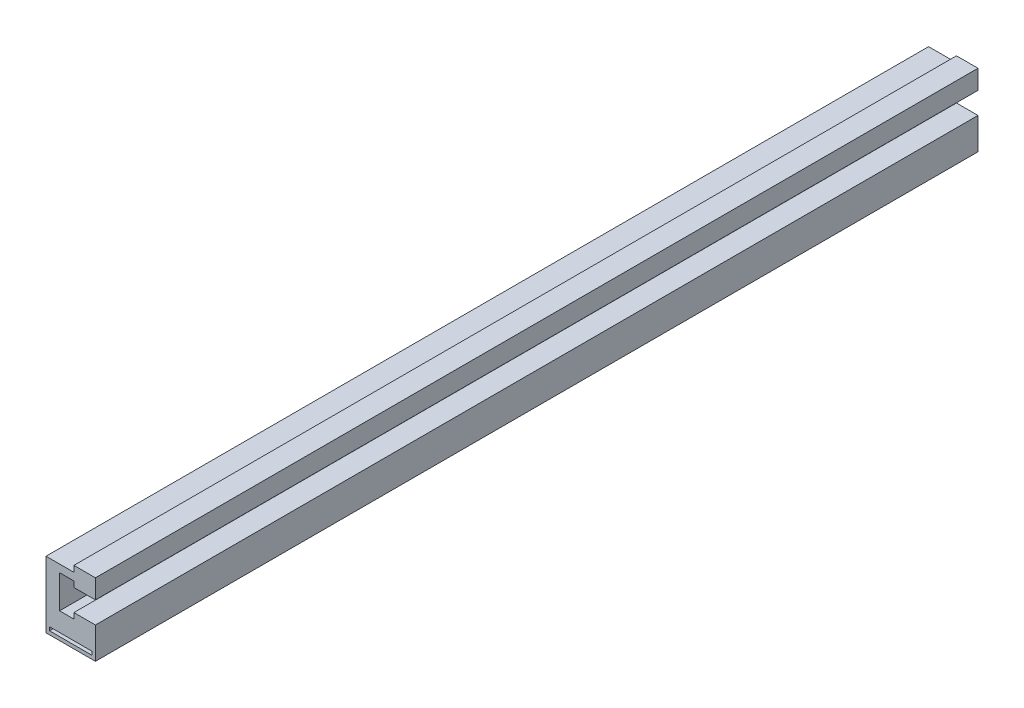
ISO-10303-21;
HEADER;
FILE_DESCRIPTION(('STEP AP214'),'2;1');
FILE_NAME('part.step','',(''),(''),'','','');
FILE_SCHEMA(('AUTOMOTIVE_DESIGN { 1 0 10303 214 1 1 1 1 }'));
ENDSEC;
DATA;
#1=APPLICATION_CONTEXT('core data for automotive mechanical design processes');
#2=APPLICATION_PROTOCOL_DEFINITION('international standard','automotive_design',2000,#1);
#3=PRODUCT_CONTEXT('',#1,'mechanical');
#4=PRODUCT('Part','Part','',(#3));
#5=PRODUCT_RELATED_PRODUCT_CATEGORY('part','',(#4));
#6=PRODUCT_DEFINITION_FORMATION('','',#4);
#7=PRODUCT_DEFINITION_CONTEXT('part definition',#1,'design');
#8=PRODUCT_DEFINITION('design','',#6,#7);
#9=PRODUCT_DEFINITION_SHAPE('','',#8);
#10=(LENGTH_UNIT() NAMED_UNIT(*) SI_UNIT(.MILLI.,.METRE.));
#11=(NAMED_UNIT(*) PLANE_ANGLE_UNIT() SI_UNIT($,.RADIAN.));
#12=(NAMED_UNIT(*) SI_UNIT($,.STERADIAN.) SOLID_ANGLE_UNIT());
#13=UNCERTAINTY_MEASURE_WITH_UNIT(LENGTH_MEASURE(1.E-05),#10,'distance_accuracy_value','');
#14=(GEOMETRIC_REPRESENTATION_CONTEXT(3) GLOBAL_UNCERTAINTY_ASSIGNED_CONTEXT((#13)) GLOBAL_UNIT_ASSIGNED_CONTEXT((#10,
#11,#12)) REPRESENTATION_CONTEXT('',''));
#15=CARTESIAN_POINT('',(0.,0.,0.));
#16=DIRECTION('',(0.,0.,1.));
#17=DIRECTION('',(1.,0.,0.));
#18=AXIS2_PLACEMENT_3D('',#15,#16,#17);
#19=CARTESIAN_POINT('',(14.,0.,0.));
#20=DIRECTION('',(0.,0.,1.));
#21=DIRECTION('',(1.,0.,0.));
#22=AXIS2_PLACEMENT_3D('',#19,#20,#21);
#23=PLANE('',#22);
#24=DIRECTION('',(0.,1.,0.));
#25=VECTOR('',#24,1.);
#26=CARTESIAN_POINT('',(14.,30.15,0.));
#27=LINE('',#26,#25);
#28=CARTESIAN_POINT('',(14.,30.15,0.));
#29=VERTEX_POINT('',#28);
#30=CARTESIAN_POINT('',(14.,41.,0.));
#31=VERTEX_POINT('',#30);
#32=EDGE_CURVE('E216',#29,#31,#27,.T.);
#33=ORIENTED_EDGE('',*,*,#32,.F.);
#34=DIRECTION('',(-1.,0.,0.));
#35=VECTOR('',#34,1.);
#36=CARTESIAN_POINT('',(14.,30.15,0.));
#37=LINE('',#36,#35);
#38=CARTESIAN_POINT('',(1.79999999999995,30.15,0.));
#39=VERTEX_POINT('',#38);
#40=EDGE_CURVE('E255',#29,#39,#37,.T.);
#41=ORIENTED_EDGE('',*,*,#40,.T.);
#42=DIRECTION('',(0.,-1.,0.));
#43=VECTOR('',#42,1.);
#44=CARTESIAN_POINT('',(1.79999999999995,33.35,0.));
#45=LINE('',#44,#43);
#46=CARTESIAN_POINT('',(1.79999999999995,33.35,0.));
#47=VERTEX_POINT('',#46);
#48=EDGE_CURVE('E252',#47,#39,#45,.T.);
#49=ORIENTED_EDGE('',*,*,#48,.F.);
#50=DIRECTION('',(-1.,0.,0.));
#51=VECTOR('',#50,1.);
#52=CARTESIAN_POINT('',(1.79999999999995,33.35,0.));
#53=LINE('',#52,#51);
#54=CARTESIAN_POINT('',(-6.30000000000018,33.35,0.));
#55=VERTEX_POINT('',#54);
#56=EDGE_CURVE('E249',#47,#55,#53,.T.);
#57=ORIENTED_EDGE('',*,*,#56,.T.);
#58=DIRECTION('',(0.,-1.,0.));
#59=VECTOR('',#58,1.);
#60=CARTESIAN_POINT('',(-6.30000000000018,33.35,0.));
#61=LINE('',#60,#59);
#62=CARTESIAN_POINT('',(-6.30000000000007,14.6499999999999,0.));
#63=VERTEX_POINT('',#62);
#64=EDGE_CURVE('E246',#55,#63,#61,.T.);
#65=ORIENTED_EDGE('',*,*,#64,.T.);
#66=DIRECTION('',(-1.,0.,0.));
#67=VECTOR('',#66,1.);
#68=CARTESIAN_POINT('',(1.79999999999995,14.6499999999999,0.));
#69=LINE('',#68,#67);
#70=CARTESIAN_POINT('',(1.79999999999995,14.6499999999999,0.));
#71=VERTEX_POINT('',#70);
#72=EDGE_CURVE('E243',#71,#63,#69,.T.);
#73=ORIENTED_EDGE('',*,*,#72,.F.);
#74=DIRECTION('',(0.,-1.,0.));
#75=VECTOR('',#74,1.);
#76=CARTESIAN_POINT('',(1.79999999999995,17.85,0.));
#77=LINE('',#76,#75);
#78=CARTESIAN_POINT('',(1.79999999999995,17.85,0.));
#79=VERTEX_POINT('',#78);
#80=EDGE_CURVE('E240',#79,#71,#77,.T.);
#81=ORIENTED_EDGE('',*,*,#80,.F.);
#82=DIRECTION('',(-1.,0.,0.));
#83=VECTOR('',#82,1.);
#84=CARTESIAN_POINT('',(14.,17.85,0.));
#85=LINE('',#84,#83);
#86=CARTESIAN_POINT('',(14.,17.85,0.));
#87=VERTEX_POINT('',#86);
#88=EDGE_CURVE('E237',#87,#79,#85,.T.);
#89=ORIENTED_EDGE('',*,*,#88,.F.);
#90=DIRECTION('',(0.,1.,0.));
#91=VECTOR('',#90,1.);
#92=CARTESIAN_POINT('',(14.,0.,0.));
#93=LINE('',#92,#91);
#94=CARTESIAN_POINT('',(14.,0.,0.));
#95=VERTEX_POINT('',#94);
#96=EDGE_CURVE('E234',#95,#87,#93,.T.);
#97=ORIENTED_EDGE('',*,*,#96,.F.);
#98=DIRECTION('',(-1.,0.,0.));
#99=VECTOR('',#98,1.);
#100=CARTESIAN_POINT('',(14.,0.,0.));
#101=LINE('',#100,#99);
#102=CARTESIAN_POINT('',(-14.,0.,0.));
#103=VERTEX_POINT('',#102);
#104=EDGE_CURVE('E231',#95,#103,#101,.T.);
#105=ORIENTED_EDGE('',*,*,#104,.T.);
#106=DIRECTION('',(0.,1.,0.));
#107=VECTOR('',#106,1.);
#108=CARTESIAN_POINT('',(-14.,0.,0.));
#109=LINE('',#108,#107);
#110=CARTESIAN_POINT('',(-14.,37.6,0.));
#111=VERTEX_POINT('',#110);
#112=EDGE_CURVE('E228',#103,#111,#109,.T.);
#113=ORIENTED_EDGE('',*,*,#112,.T.);
#114=DIRECTION('',(-1.,0.,0.));
#115=VECTOR('',#114,1.);
#116=CARTESIAN_POINT('',(1.79999999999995,37.6,0.));
#117=LINE('',#116,#115);
#118=CARTESIAN_POINT('',(1.79999999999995,37.6,0.));
#119=VERTEX_POINT('',#118);
#120=EDGE_CURVE('E225',#119,#111,#117,.T.);
#121=ORIENTED_EDGE('',*,*,#120,.F.);
#122=DIRECTION('',(0.,1.,0.));
#123=VECTOR('',#122,1.);
#124=CARTESIAN_POINT('',(1.79999999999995,37.6,0.));
#125=LINE('',#124,#123);
#126=CARTESIAN_POINT('',(1.79999999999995,41.,0.));
#127=VERTEX_POINT('',#126);
#128=EDGE_CURVE('E222',#119,#127,#125,.T.);
#129=ORIENTED_EDGE('',*,*,#128,.T.);
#130=DIRECTION('',(-1.,0.,0.));
#131=VECTOR('',#130,1.);
#132=CARTESIAN_POINT('',(14.,41.,0.));
#133=LINE('',#132,#131);
#134=EDGE_CURVE('E219',#31,#127,#133,.T.);
#135=ORIENTED_EDGE('',*,*,#134,.F.);
#136=EDGE_LOOP('',(#33,#41,#49,#57,#65,#73,#81,#89,#97,#105,#113,#121,#129,#135));
#137=FACE_BOUND('',#136,.T.);
#138=DIRECTION('',(0.,1.,0.));
#139=VECTOR('',#138,1.);
#140=CARTESIAN_POINT('',(-12.,1.99999999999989,0.));
#141=LINE('',#140,#139);
#142=CARTESIAN_POINT('',(-12.,1.99999999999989,0.));
#143=VERTEX_POINT('',#142);
#144=CARTESIAN_POINT('',(-12.,3.99999999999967,0.));
#145=VERTEX_POINT('',#144);
#146=EDGE_CURVE('E140',#143,#145,#141,.T.);
#147=ORIENTED_EDGE('',*,*,#146,.F.);
#148=DIRECTION('',(1.,0.,0.));
#149=VECTOR('',#148,1.);
#150=CARTESIAN_POINT('',(-12.,1.99999999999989,0.));
#151=LINE('',#150,#149);
#152=CARTESIAN_POINT('',(12.,2.,0.));
#153=VERTEX_POINT('',#152);
#154=EDGE_CURVE('E167',#143,#153,#151,.T.);
#155=ORIENTED_EDGE('',*,*,#154,.T.);
#156=DIRECTION('',(0.,-1.,0.));
#157=VECTOR('',#156,1.);
#158=CARTESIAN_POINT('',(12.,3.9999999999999,0.));
#159=LINE('',#158,#157);
#160=CARTESIAN_POINT('',(12.,3.9999999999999,0.));
#161=VERTEX_POINT('',#160);
#162=EDGE_CURVE('E29',#161,#153,#159,.T.);
#163=ORIENTED_EDGE('',*,*,#162,.F.);
#164=DIRECTION('',(-1.,0.,0.));
#165=VECTOR('',#164,1.);
#166=CARTESIAN_POINT('',(12.,3.9999999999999,0.));
#167=LINE('',#166,#165);
#168=EDGE_CURVE('E164',#161,#145,#167,.T.);
#169=ORIENTED_EDGE('',*,*,#168,.T.);
#170=EDGE_LOOP('',(#147,#155,#163,#169));
#171=FACE_BOUND('',#170,.T.);
#172=ADVANCED_FACE('F14',(#137,#171),#23,.F.);
#173=CARTESIAN_POINT('',(14.,0.,500.));
#174=DIRECTION('',(0.,0.,1.));
#175=DIRECTION('',(1.,0.,0.));
#176=AXIS2_PLACEMENT_3D('',#173,#174,#175);
#177=PLANE('',#176);
#178=DIRECTION('',(0.,1.,0.));
#179=VECTOR('',#178,1.);
#180=CARTESIAN_POINT('',(14.,30.15,500.));
#181=LINE('',#180,#179);
#182=CARTESIAN_POINT('',(14.,30.15,500.));
#183=VERTEX_POINT('',#182);
#184=CARTESIAN_POINT('',(14.,41.,500.));
#185=VERTEX_POINT('',#184);
#186=EDGE_CURVE('E144',#183,#185,#181,.T.);
#187=ORIENTED_EDGE('',*,*,#186,.T.);
#188=DIRECTION('',(-1.,0.,0.));
#189=VECTOR('',#188,1.);
#190=CARTESIAN_POINT('',(14.,41.,500.));
#191=LINE('',#190,#189);
#192=CARTESIAN_POINT('',(1.79999999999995,41.,500.));
#193=VERTEX_POINT('',#192);
#194=EDGE_CURVE('E177',#185,#193,#191,.T.);
#195=ORIENTED_EDGE('',*,*,#194,.T.);
#196=DIRECTION('',(0.,1.,0.));
#197=VECTOR('',#196,1.);
#198=CARTESIAN_POINT('',(1.79999999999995,37.6,500.));
#199=LINE('',#198,#197);
#200=CARTESIAN_POINT('',(1.79999999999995,37.6,500.));
#201=VERTEX_POINT('',#200);
#202=EDGE_CURVE('E180',#201,#193,#199,.T.);
#203=ORIENTED_EDGE('',*,*,#202,.F.);
#204=DIRECTION('',(-1.,0.,0.));
#205=VECTOR('',#204,1.);
#206=CARTESIAN_POINT('',(1.79999999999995,37.6,500.));
#207=LINE('',#206,#205);
#208=CARTESIAN_POINT('',(-14.,37.6,500.));
#209=VERTEX_POINT('',#208);
#210=EDGE_CURVE('E183',#201,#209,#207,.T.);
#211=ORIENTED_EDGE('',*,*,#210,.T.);
#212=DIRECTION('',(0.,1.,0.));
#213=VECTOR('',#212,1.);
#214=CARTESIAN_POINT('',(-14.,0.,500.));
#215=LINE('',#214,#213);
#216=CARTESIAN_POINT('',(-14.,0.,500.));
#217=VERTEX_POINT('',#216);
#218=EDGE_CURVE('E186',#217,#209,#215,.T.);
#219=ORIENTED_EDGE('',*,*,#218,.F.);
#220=DIRECTION('',(-1.,0.,0.));
#221=VECTOR('',#220,1.);
#222=CARTESIAN_POINT('',(14.,0.,500.));
#223=LINE('',#222,#221);
#224=CARTESIAN_POINT('',(14.,0.,500.));
#225=VERTEX_POINT('',#224);
#226=EDGE_CURVE('E189',#225,#217,#223,.T.);
#227=ORIENTED_EDGE('',*,*,#226,.F.);
#228=DIRECTION('',(0.,1.,0.));
#229=VECTOR('',#228,1.);
#230=CARTESIAN_POINT('',(14.,0.,500.));
#231=LINE('',#230,#229);
#232=CARTESIAN_POINT('',(14.,17.85,500.));
#233=VERTEX_POINT('',#232);
#234=EDGE_CURVE('E192',#225,#233,#231,.T.);
#235=ORIENTED_EDGE('',*,*,#234,.T.);
#236=DIRECTION('',(-1.,0.,0.));
#237=VECTOR('',#236,1.);
#238=CARTESIAN_POINT('',(14.,17.85,500.));
#239=LINE('',#238,#237);
#240=CARTESIAN_POINT('',(1.79999999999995,17.85,500.));
#241=VERTEX_POINT('',#240);
#242=EDGE_CURVE('E195',#233,#241,#239,.T.);
#243=ORIENTED_EDGE('',*,*,#242,.T.);
#244=DIRECTION('',(0.,-1.,0.));
#245=VECTOR('',#244,1.);
#246=CARTESIAN_POINT('',(1.79999999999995,17.85,500.));
#247=LINE('',#246,#245);
#248=CARTESIAN_POINT('',(1.79999999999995,14.6499999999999,500.));
#249=VERTEX_POINT('',#248);
#250=EDGE_CURVE('E198',#241,#249,#247,.T.);
#251=ORIENTED_EDGE('',*,*,#250,.T.);
#252=DIRECTION('',(-1.,0.,0.));
#253=VECTOR('',#252,1.);
#254=CARTESIAN_POINT('',(1.79999999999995,14.6499999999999,500.));
#255=LINE('',#254,#253);
#256=CARTESIAN_POINT('',(-6.30000000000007,14.6499999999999,500.));
#257=VERTEX_POINT('',#256);
#258=EDGE_CURVE('E201',#249,#257,#255,.T.);
#259=ORIENTED_EDGE('',*,*,#258,.T.);
#260=DIRECTION('',(0.,-1.,0.));
#261=VECTOR('',#260,1.);
#262=CARTESIAN_POINT('',(-6.30000000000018,33.35,500.));
#263=LINE('',#262,#261);
#264=CARTESIAN_POINT('',(-6.30000000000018,33.35,500.));
#265=VERTEX_POINT('',#264);
#266=EDGE_CURVE('E204',#265,#257,#263,.T.);
#267=ORIENTED_EDGE('',*,*,#266,.F.);
#268=DIRECTION('',(-1.,0.,0.));
#269=VECTOR('',#268,1.);
#270=CARTESIAN_POINT('',(1.79999999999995,33.35,500.));
#271=LINE('',#270,#269);
#272=CARTESIAN_POINT('',(1.79999999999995,33.35,500.));
#273=VERTEX_POINT('',#272);
#274=EDGE_CURVE('E207',#273,#265,#271,.T.);
#275=ORIENTED_EDGE('',*,*,#274,.F.);
#276=DIRECTION('',(0.,-1.,0.));
#277=VECTOR('',#276,1.);
#278=CARTESIAN_POINT('',(1.79999999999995,33.35,500.));
#279=LINE('',#278,#277);
#280=CARTESIAN_POINT('',(1.79999999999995,30.15,500.));
#281=VERTEX_POINT('',#280);
#282=EDGE_CURVE('E210',#273,#281,#279,.T.);
#283=ORIENTED_EDGE('',*,*,#282,.T.);
#284=DIRECTION('',(-1.,0.,0.));
#285=VECTOR('',#284,1.);
#286=CARTESIAN_POINT('',(14.,30.15,500.));
#287=LINE('',#286,#285);
#288=EDGE_CURVE('E213',#183,#281,#287,.T.);
#289=ORIENTED_EDGE('',*,*,#288,.F.);
#290=EDGE_LOOP('',(#187,#195,#203,#211,#219,#227,#235,#243,#251,#259,#267,#275,#283,#289));
#291=FACE_BOUND('',#290,.T.);
#292=DIRECTION('',(1.,0.,0.));
#293=VECTOR('',#292,1.);
#294=CARTESIAN_POINT('',(-12.,1.99999999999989,500.));
#295=LINE('',#294,#293);
#296=CARTESIAN_POINT('',(-12.,1.99999999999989,500.));
#297=VERTEX_POINT('',#296);
#298=CARTESIAN_POINT('',(12.,2.,500.));
#299=VERTEX_POINT('',#298);
#300=EDGE_CURVE('E158',#297,#299,#295,.T.);
#301=ORIENTED_EDGE('',*,*,#300,.F.);
#302=DIRECTION('',(0.,1.,0.));
#303=VECTOR('',#302,1.);
#304=CARTESIAN_POINT('',(-12.,1.99999999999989,500.));
#305=LINE('',#304,#303);
#306=CARTESIAN_POINT('',(-12.,3.99999999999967,500.));
#307=VERTEX_POINT('',#306);
#308=EDGE_CURVE('E37',#297,#307,#305,.T.);
#309=ORIENTED_EDGE('',*,*,#308,.T.);
#310=DIRECTION('',(-1.,0.,0.));
#311=VECTOR('',#310,1.);
#312=CARTESIAN_POINT('',(12.,3.9999999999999,500.));
#313=LINE('',#312,#311);
#314=CARTESIAN_POINT('',(12.,3.9999999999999,500.));
#315=VERTEX_POINT('',#314);
#316=EDGE_CURVE('E148',#315,#307,#313,.T.);
#317=ORIENTED_EDGE('',*,*,#316,.F.);
#318=DIRECTION('',(0.,-1.,0.));
#319=VECTOR('',#318,1.);
#320=CARTESIAN_POINT('',(12.,3.9999999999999,500.));
#321=LINE('',#320,#319);
#322=EDGE_CURVE('E153',#315,#299,#321,.T.);
#323=ORIENTED_EDGE('',*,*,#322,.T.);
#324=EDGE_LOOP('',(#301,#309,#317,#323));
#325=FACE_BOUND('',#324,.T.);
#326=ADVANCED_FACE('F156',(#291,#325),#177,.T.);
#327=CARTESIAN_POINT('',(14.,30.15,0.));
#328=DIRECTION('',(1.,0.,0.));
#329=DIRECTION('',(0.,0.,-1.));
#330=AXIS2_PLACEMENT_3D('',#327,#328,#329);
#331=PLANE('',#330);
#332=DIRECTION('',(0.,0.,1.));
#333=VECTOR('',#332,1.);
#334=CARTESIAN_POINT('',(14.,30.15,0.));
#335=LINE('',#334,#333);
#336=EDGE_CURVE('E9',#29,#183,#335,.T.);
#337=ORIENTED_EDGE('',*,*,#336,.F.);
#338=ORIENTED_EDGE('',*,*,#32,.T.);
#339=DIRECTION('',(0.,0.,1.));
#340=VECTOR('',#339,1.);
#341=CARTESIAN_POINT('',(14.,41.,0.));
#342=LINE('',#341,#340);
#343=EDGE_CURVE('E258',#31,#185,#342,.T.);
#344=ORIENTED_EDGE('',*,*,#343,.T.);
#345=ORIENTED_EDGE('',*,*,#186,.F.);
#346=EDGE_LOOP('',(#337,#338,#344,#345));
#347=FACE_BOUND('',#346,.T.);
#348=ADVANCED_FACE('F294',(#347),#331,.T.);
#349=CARTESIAN_POINT('',(14.,30.15,0.));
#350=DIRECTION('',(0.,1.,0.));
#351=DIRECTION('',(0.,0.,-1.));
#352=AXIS2_PLACEMENT_3D('',#349,#350,#351);
#353=PLANE('',#352);
#354=DIRECTION('',(0.,0.,1.));
#355=VECTOR('',#354,1.);
#356=CARTESIAN_POINT('',(1.79999999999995,30.15,0.));
#357=LINE('',#356,#355);
#358=EDGE_CURVE('E22',#39,#281,#357,.T.);
#359=ORIENTED_EDGE('',*,*,#358,.F.);
#360=ORIENTED_EDGE('',*,*,#40,.F.);
#361=ORIENTED_EDGE('',*,*,#336,.T.);
#362=ORIENTED_EDGE('',*,*,#288,.T.);
#363=EDGE_LOOP('',(#359,#360,#361,#362));
#364=FACE_BOUND('',#363,.T.);
#365=ADVANCED_FACE('F16',(#364),#353,.F.);
#366=CARTESIAN_POINT('',(1.79999999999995,33.35,0.));
#367=DIRECTION('',(-1.,0.,0.));
#368=DIRECTION('',(0.,0.,1.));
#369=AXIS2_PLACEMENT_3D('',#366,#367,#368);
#370=PLANE('',#369);
#371=DIRECTION('',(0.,0.,1.));
#372=VECTOR('',#371,1.);
#373=CARTESIAN_POINT('',(1.79999999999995,33.35,0.));
#374=LINE('',#373,#372);
#375=EDGE_CURVE('E280',#47,#273,#374,.T.);
#376=ORIENTED_EDGE('',*,*,#375,.F.);
#377=ORIENTED_EDGE('',*,*,#48,.T.);
#378=ORIENTED_EDGE('',*,*,#358,.T.);
#379=ORIENTED_EDGE('',*,*,#282,.F.);
#380=EDGE_LOOP('',(#376,#377,#378,#379));
#381=FACE_BOUND('',#380,.T.);
#382=ADVANCED_FACE('F283',(#381),#370,.T.);
#383=CARTESIAN_POINT('',(1.79999999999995,33.35,0.));
#384=DIRECTION('',(0.,1.,0.));
#385=DIRECTION('',(0.,0.,-1.));
#386=AXIS2_PLACEMENT_3D('',#383,#384,#385);
#387=PLANE('',#386);
#388=DIRECTION('',(0.,0.,1.));
#389=VECTOR('',#388,1.);
#390=CARTESIAN_POINT('',(-6.30000000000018,33.35,0.));
#391=LINE('',#390,#389);
#392=EDGE_CURVE('E278',#55,#265,#391,.T.);
#393=ORIENTED_EDGE('',*,*,#392,.F.);
#394=ORIENTED_EDGE('',*,*,#56,.F.);
#395=ORIENTED_EDGE('',*,*,#375,.T.);
#396=ORIENTED_EDGE('',*,*,#274,.T.);
#397=EDGE_LOOP('',(#393,#394,#395,#396));
#398=FACE_BOUND('',#397,.T.);
#399=ADVANCED_FACE('F335',(#398),#387,.F.);
#400=CARTESIAN_POINT('',(-6.30000000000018,33.35,0.));
#401=DIRECTION('',(-1.,0.,0.));
#402=DIRECTION('',(0.,1.,0.));
#403=AXIS2_PLACEMENT_3D('',#400,#401,#402);
#404=PLANE('',#403);
#405=DIRECTION('',(0.,0.,1.));
#406=VECTOR('',#405,1.);
#407=CARTESIAN_POINT('',(-6.30000000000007,14.6499999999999,0.));
#408=LINE('',#407,#406);
#409=EDGE_CURVE('E276',#63,#257,#408,.T.);
#410=ORIENTED_EDGE('',*,*,#409,.F.);
#411=ORIENTED_EDGE('',*,*,#64,.F.);
#412=ORIENTED_EDGE('',*,*,#392,.T.);
#413=ORIENTED_EDGE('',*,*,#266,.T.);
#414=EDGE_LOOP('',(#410,#411,#412,#413));
#415=FACE_BOUND('',#414,.T.);
#416=ADVANCED_FACE('F333',(#415),#404,.F.);
#417=CARTESIAN_POINT('',(1.79999999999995,14.6499999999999,0.));
#418=DIRECTION('',(0.,1.,0.));
#419=DIRECTION('',(0.,0.,-1.));
#420=AXIS2_PLACEMENT_3D('',#417,#418,#419);
#421=PLANE('',#420);
#422=DIRECTION('',(0.,0.,1.));
#423=VECTOR('',#422,1.);
#424=CARTESIAN_POINT('',(1.79999999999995,14.6499999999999,0.));
#425=LINE('',#424,#423);
#426=EDGE_CURVE('E274',#71,#249,#425,.T.);
#427=ORIENTED_EDGE('',*,*,#426,.F.);
#428=ORIENTED_EDGE('',*,*,#72,.T.);
#429=ORIENTED_EDGE('',*,*,#409,.T.);
#430=ORIENTED_EDGE('',*,*,#258,.F.);
#431=EDGE_LOOP('',(#427,#428,#429,#430));
#432=FACE_BOUND('',#431,.T.);
#433=ADVANCED_FACE('F330',(#432),#421,.T.);
#434=CARTESIAN_POINT('',(1.79999999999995,17.85,0.));
#435=DIRECTION('',(-1.,0.,0.));
#436=DIRECTION('',(0.,0.,1.));
#437=AXIS2_PLACEMENT_3D('',#434,#435,#436);
#438=PLANE('',#437);
#439=DIRECTION('',(0.,0.,1.));
#440=VECTOR('',#439,1.);
#441=CARTESIAN_POINT('',(1.79999999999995,17.85,0.));
#442=LINE('',#441,#440);
#443=EDGE_CURVE('E272',#79,#241,#442,.T.);
#444=ORIENTED_EDGE('',*,*,#443,.F.);
#445=ORIENTED_EDGE('',*,*,#80,.T.);
#446=ORIENTED_EDGE('',*,*,#426,.T.);
#447=ORIENTED_EDGE('',*,*,#250,.F.);
#448=EDGE_LOOP('',(#444,#445,#446,#447));
#449=FACE_BOUND('',#448,.T.);
#450=ADVANCED_FACE('F326',(#449),#438,.T.);
#451=CARTESIAN_POINT('',(14.,17.85,0.));
#452=DIRECTION('',(0.,1.,0.));
#453=DIRECTION('',(0.,0.,-1.));
#454=AXIS2_PLACEMENT_3D('',#451,#452,#453);
#455=PLANE('',#454);
#456=DIRECTION('',(0.,0.,1.));
#457=VECTOR('',#456,1.);
#458=CARTESIAN_POINT('',(14.,17.85,0.));
#459=LINE('',#458,#457);
#460=EDGE_CURVE('E270',#87,#233,#459,.T.);
#461=ORIENTED_EDGE('',*,*,#460,.F.);
#462=ORIENTED_EDGE('',*,*,#88,.T.);
#463=ORIENTED_EDGE('',*,*,#443,.T.);
#464=ORIENTED_EDGE('',*,*,#242,.F.);
#465=EDGE_LOOP('',(#461,#462,#463,#464));
#466=FACE_BOUND('',#465,.T.);
#467=ADVANCED_FACE('F323',(#466),#455,.T.);
#468=CARTESIAN_POINT('',(14.,0.,0.));
#469=DIRECTION('',(1.,0.,0.));
#470=DIRECTION('',(0.,0.,-1.));
#471=AXIS2_PLACEMENT_3D('',#468,#469,#470);
#472=PLANE('',#471);
#473=DIRECTION('',(0.,0.,1.));
#474=VECTOR('',#473,1.);
#475=CARTESIAN_POINT('',(14.,0.,0.));
#476=LINE('',#475,#474);
#477=EDGE_CURVE('E268',#95,#225,#476,.T.);
#478=ORIENTED_EDGE('',*,*,#477,.F.);
#479=ORIENTED_EDGE('',*,*,#96,.T.);
#480=ORIENTED_EDGE('',*,*,#460,.T.);
#481=ORIENTED_EDGE('',*,*,#234,.F.);
#482=EDGE_LOOP('',(#478,#479,#480,#481));
#483=FACE_BOUND('',#482,.T.);
#484=ADVANCED_FACE('F318',(#483),#472,.T.);
#485=CARTESIAN_POINT('',(14.,0.,0.));
#486=DIRECTION('',(0.,1.,0.));
#487=DIRECTION('',(0.,0.,-1.));
#488=AXIS2_PLACEMENT_3D('',#485,#486,#487);
#489=PLANE('',#488);
#490=DIRECTION('',(0.,0.,1.));
#491=VECTOR('',#490,1.);
#492=CARTESIAN_POINT('',(-14.,0.,0.));
#493=LINE('',#492,#491);
#494=EDGE_CURVE('E266',#103,#217,#493,.T.);
#495=ORIENTED_EDGE('',*,*,#494,.F.);
#496=ORIENTED_EDGE('',*,*,#104,.F.);
#497=ORIENTED_EDGE('',*,*,#477,.T.);
#498=ORIENTED_EDGE('',*,*,#226,.T.);
#499=EDGE_LOOP('',(#495,#496,#497,#498));
#500=FACE_BOUND('',#499,.T.);
#501=ADVANCED_FACE('F314',(#500),#489,.F.);
#502=CARTESIAN_POINT('',(-14.,0.,0.));
#503=DIRECTION('',(1.,0.,0.));
#504=DIRECTION('',(0.,0.,-1.));
#505=AXIS2_PLACEMENT_3D('',#502,#503,#504);
#506=PLANE('',#505);
#507=DIRECTION('',(0.,0.,1.));
#508=VECTOR('',#507,1.);
#509=CARTESIAN_POINT('',(-14.,37.6,0.));
#510=LINE('',#509,#508);
#511=EDGE_CURVE('E264',#111,#209,#510,.T.);
#512=ORIENTED_EDGE('',*,*,#511,.F.);
#513=ORIENTED_EDGE('',*,*,#112,.F.);
#514=ORIENTED_EDGE('',*,*,#494,.T.);
#515=ORIENTED_EDGE('',*,*,#218,.T.);
#516=EDGE_LOOP('',(#512,#513,#514,#515));
#517=FACE_BOUND('',#516,.T.);
#518=ADVANCED_FACE('F310',(#517),#506,.F.);
#519=CARTESIAN_POINT('',(1.79999999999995,37.6,0.));
#520=DIRECTION('',(0.,1.,0.));
#521=DIRECTION('',(1.,0.,0.));
#522=AXIS2_PLACEMENT_3D('',#519,#520,#521);
#523=PLANE('',#522);
#524=DIRECTION('',(0.,0.,1.));
#525=VECTOR('',#524,1.);
#526=CARTESIAN_POINT('',(1.79999999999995,37.6,0.));
#527=LINE('',#526,#525);
#528=EDGE_CURVE('E262',#119,#201,#527,.T.);
#529=ORIENTED_EDGE('',*,*,#528,.F.);
#530=ORIENTED_EDGE('',*,*,#120,.T.);
#531=ORIENTED_EDGE('',*,*,#511,.T.);
#532=ORIENTED_EDGE('',*,*,#210,.F.);
#533=EDGE_LOOP('',(#529,#530,#531,#532));
#534=FACE_BOUND('',#533,.T.);
#535=ADVANCED_FACE('F307',(#534),#523,.T.);
#536=CARTESIAN_POINT('',(1.79999999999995,37.6,0.));
#537=DIRECTION('',(1.,0.,0.));
#538=DIRECTION('',(0.,0.,-1.));
#539=AXIS2_PLACEMENT_3D('',#536,#537,#538);
#540=PLANE('',#539);
#541=DIRECTION('',(0.,0.,1.));
#542=VECTOR('',#541,1.);
#543=CARTESIAN_POINT('',(1.79999999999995,41.,0.));
#544=LINE('',#543,#542);
#545=EDGE_CURVE('E260',#127,#193,#544,.T.);
#546=ORIENTED_EDGE('',*,*,#545,.F.);
#547=ORIENTED_EDGE('',*,*,#128,.F.);
#548=ORIENTED_EDGE('',*,*,#528,.T.);
#549=ORIENTED_EDGE('',*,*,#202,.T.);
#550=EDGE_LOOP('',(#546,#547,#548,#549));
#551=FACE_BOUND('',#550,.T.);
#552=ADVANCED_FACE('F302',(#551),#540,.F.);
#553=CARTESIAN_POINT('',(14.,41.,0.));
#554=DIRECTION('',(0.,1.,0.));
#555=DIRECTION('',(1.,0.,0.));
#556=AXIS2_PLACEMENT_3D('',#553,#554,#555);
#557=PLANE('',#556);
#558=ORIENTED_EDGE('',*,*,#134,.T.);
#559=ORIENTED_EDGE('',*,*,#545,.T.);
#560=ORIENTED_EDGE('',*,*,#194,.F.);
#561=ORIENTED_EDGE('',*,*,#343,.F.);
#562=EDGE_LOOP('',(#558,#559,#560,#561));
#563=FACE_BOUND('',#562,.T.);
#564=ADVANCED_FACE('F298',(#563),#557,.T.);
#565=CARTESIAN_POINT('',(-12.,1.99999999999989,0.));
#566=DIRECTION('',(1.,0.,0.));
#567=DIRECTION('',(0.,0.,-1.));
#568=AXIS2_PLACEMENT_3D('',#565,#566,#567);
#569=PLANE('',#568);
#570=DIRECTION('',(0.,0.,1.));
#571=VECTOR('',#570,1.);
#572=CARTESIAN_POINT('',(-12.,3.99999999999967,0.));
#573=LINE('',#572,#571);
#574=EDGE_CURVE('E136',#145,#307,#573,.T.);
#575=ORIENTED_EDGE('',*,*,#574,.T.);
#576=ORIENTED_EDGE('',*,*,#308,.F.);
#577=DIRECTION('',(0.,0.,1.));
#578=VECTOR('',#577,1.);
#579=CARTESIAN_POINT('',(-12.,1.99999999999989,0.));
#580=LINE('',#579,#578);
#581=EDGE_CURVE('E170',#143,#297,#580,.T.);
#582=ORIENTED_EDGE('',*,*,#581,.F.);
#583=ORIENTED_EDGE('',*,*,#146,.T.);
#584=EDGE_LOOP('',(#575,#576,#582,#583));
#585=FACE_BOUND('',#584,.T.);
#586=ADVANCED_FACE('F138',(#585),#569,.T.);
#587=CARTESIAN_POINT('',(12.,3.9999999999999,0.));
#588=DIRECTION('',(0.,1.,0.));
#589=DIRECTION('',(1.,0.,0.));
#590=AXIS2_PLACEMENT_3D('',#587,#588,#589);
#591=PLANE('',#590);
#592=DIRECTION('',(0.,0.,1.));
#593=VECTOR('',#592,1.);
#594=CARTESIAN_POINT('',(12.,3.9999999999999,0.));
#595=LINE('',#594,#593);
#596=EDGE_CURVE('E145',#161,#315,#595,.T.);
#597=ORIENTED_EDGE('',*,*,#596,.T.);
#598=ORIENTED_EDGE('',*,*,#316,.T.);
#599=ORIENTED_EDGE('',*,*,#574,.F.);
#600=ORIENTED_EDGE('',*,*,#168,.F.);
#601=EDGE_LOOP('',(#597,#598,#599,#600));
#602=FACE_BOUND('',#601,.T.);
#603=ADVANCED_FACE('F149',(#602),#591,.F.);
#604=CARTESIAN_POINT('',(12.,3.9999999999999,0.));
#605=DIRECTION('',(-1.,0.,0.));
#606=DIRECTION('',(0.,0.,1.));
#607=AXIS2_PLACEMENT_3D('',#604,#605,#606);
#608=PLANE('',#607);
#609=DIRECTION('',(0.,0.,1.));
#610=VECTOR('',#609,1.);
#611=CARTESIAN_POINT('',(12.,2.,0.));
#612=LINE('',#611,#610);
#613=EDGE_CURVE('E172',#153,#299,#612,.T.);
#614=ORIENTED_EDGE('',*,*,#613,.T.);
#615=ORIENTED_EDGE('',*,*,#322,.F.);
#616=ORIENTED_EDGE('',*,*,#596,.F.);
#617=ORIENTED_EDGE('',*,*,#162,.T.);
#618=EDGE_LOOP('',(#614,#615,#616,#617));
#619=FACE_BOUND('',#618,.T.);
#620=ADVANCED_FACE('F344',(#619),#608,.T.);
#621=CARTESIAN_POINT('',(-12.,1.99999999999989,0.));
#622=DIRECTION('',(0.,-1.,0.));
#623=DIRECTION('',(-1.,0.,0.));
#624=AXIS2_PLACEMENT_3D('',#621,#622,#623);
#625=PLANE('',#624);
#626=ORIENTED_EDGE('',*,*,#154,.F.);
#627=ORIENTED_EDGE('',*,*,#581,.T.);
#628=ORIENTED_EDGE('',*,*,#300,.T.);
#629=ORIENTED_EDGE('',*,*,#613,.F.);
#630=EDGE_LOOP('',(#626,#627,#628,#629));
#631=FACE_BOUND('',#630,.T.);
#632=ADVANCED_FACE('F343',(#631),#625,.F.);
#633=CLOSED_SHELL('',(#172,#326,#348,#365,#382,#399,#416,#433,#450,#467,#484,#501,#518,#535,
#552,#564,#586,#603,#620,#632));
#634=MANIFOLD_SOLID_BREP('B1',#633);
#635=ADVANCED_BREP_SHAPE_REPRESENTATION('',(#18,#634),#14);
#636=SHAPE_DEFINITION_REPRESENTATION(#9,#635);
ENDSEC;
END-ISO-10303-21;
